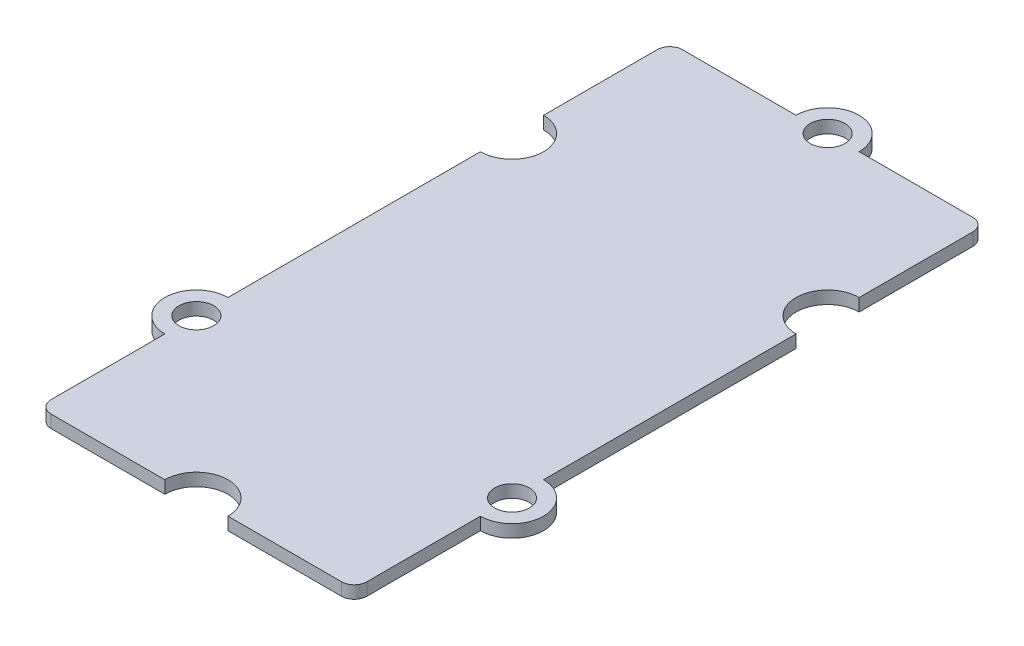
ISO-10303-21;
HEADER;
FILE_DESCRIPTION(('STEP AP214'),'2;1');
FILE_NAME('part.step','',(''),(''),'','','');
FILE_SCHEMA(('AUTOMOTIVE_DESIGN { 1 0 10303 214 1 1 1 1 }'));
ENDSEC;
DATA;
#1=APPLICATION_CONTEXT('core data for automotive mechanical design processes');
#2=APPLICATION_PROTOCOL_DEFINITION('international standard','automotive_design',2000,#1);
#3=PRODUCT_CONTEXT('',#1,'mechanical');
#4=PRODUCT('Part','Part','',(#3));
#5=PRODUCT_RELATED_PRODUCT_CATEGORY('part','',(#4));
#6=PRODUCT_DEFINITION_FORMATION('','',#4);
#7=PRODUCT_DEFINITION_CONTEXT('part definition',#1,'design');
#8=PRODUCT_DEFINITION('design','',#6,#7);
#9=PRODUCT_DEFINITION_SHAPE('','',#8);
#10=(LENGTH_UNIT() NAMED_UNIT(*) SI_UNIT(.MILLI.,.METRE.));
#11=(NAMED_UNIT(*) PLANE_ANGLE_UNIT() SI_UNIT($,.RADIAN.));
#12=(NAMED_UNIT(*) SI_UNIT($,.STERADIAN.) SOLID_ANGLE_UNIT());
#13=UNCERTAINTY_MEASURE_WITH_UNIT(LENGTH_MEASURE(1.E-05),#10,'distance_accuracy_value','');
#14=(GEOMETRIC_REPRESENTATION_CONTEXT(3) GLOBAL_UNCERTAINTY_ASSIGNED_CONTEXT((#13)) GLOBAL_UNIT_ASSIGNED_CONTEXT((#10,
#11,#12)) REPRESENTATION_CONTEXT('',''));
#15=CARTESIAN_POINT('',(0.,0.,0.));
#16=DIRECTION('',(0.,0.,1.));
#17=DIRECTION('',(1.,0.,0.));
#18=AXIS2_PLACEMENT_3D('',#15,#16,#17);
#19=CARTESIAN_POINT('',(0.8,0.8,-0.8));
#20=DIRECTION('',(0.,-1.,0.));
#21=DIRECTION('',(0.,0.,-1.));
#22=AXIS2_PLACEMENT_3D('',#19,#20,#21);
#23=PLANE('',#22);
#24=CARTESIAN_POINT('',(0.8,0.8,-0.8));
#25=DIRECTION('',(0.,1.,0.));
#26=DIRECTION('',(0.,0.,-1.));
#27=AXIS2_PLACEMENT_3D('',#24,#25,#26);
#28=CIRCLE('',#27,0.8);
#29=CARTESIAN_POINT('',(0.,0.8,-0.800000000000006));
#30=VERTEX_POINT('',#29);
#31=CARTESIAN_POINT('',(0.800000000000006,0.8,0.));
#32=VERTEX_POINT('',#31);
#33=EDGE_CURVE('E242',#30,#32,#28,.T.);
#34=ORIENTED_EDGE('',*,*,#33,.T.);
#35=DIRECTION('',(1.,0.,0.));
#36=VECTOR('',#35,1.);
#37=CARTESIAN_POINT('',(0.800000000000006,0.8,0.));
#38=LINE('',#37,#36);
#39=CARTESIAN_POINT('',(8.,0.8,0.));
#40=VERTEX_POINT('',#39);
#41=EDGE_CURVE('E130',#32,#40,#38,.T.);
#42=ORIENTED_EDGE('',*,*,#41,.T.);
#43=CARTESIAN_POINT('',(10.,0.8,0.));
#44=DIRECTION('',(0.,-1.,0.));
#45=DIRECTION('',(0.,0.,1.));
#46=AXIS2_PLACEMENT_3D('',#43,#44,#45);
#47=CIRCLE('',#46,2.);
#48=CARTESIAN_POINT('',(12.,0.8,0.));
#49=VERTEX_POINT('',#48);
#50=EDGE_CURVE('E293',#40,#49,#47,.T.);
#51=ORIENTED_EDGE('',*,*,#50,.T.);
#52=DIRECTION('',(1.,0.,0.));
#53=VECTOR('',#52,1.);
#54=CARTESIAN_POINT('',(12.,0.8,0.));
#55=LINE('',#54,#53);
#56=CARTESIAN_POINT('',(19.2,0.8,0.));
#57=VERTEX_POINT('',#56);
#58=EDGE_CURVE('E312',#49,#57,#55,.T.);
#59=ORIENTED_EDGE('',*,*,#58,.T.);
#60=CARTESIAN_POINT('',(19.2,0.8,-0.8));
#61=DIRECTION('',(0.,1.,0.));
#62=DIRECTION('',(0.,0.,1.));
#63=AXIS2_PLACEMENT_3D('',#60,#61,#62);
#64=CIRCLE('',#63,0.799999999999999);
#65=CARTESIAN_POINT('',(20.,0.8,-0.800000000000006));
#66=VERTEX_POINT('',#65);
#67=EDGE_CURVE('E309',#57,#66,#64,.T.);
#68=ORIENTED_EDGE('',*,*,#67,.T.);
#69=DIRECTION('',(0.,0.,-1.));
#70=VECTOR('',#69,1.);
#71=CARTESIAN_POINT('',(20.,0.8,-0.800000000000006));
#72=LINE('',#71,#70);
#73=CARTESIAN_POINT('',(20.,0.8,-8.));
#74=VERTEX_POINT('',#73);
#75=EDGE_CURVE('E311',#66,#74,#72,.T.);
#76=ORIENTED_EDGE('',*,*,#75,.T.);
#77=CARTESIAN_POINT('',(20.,0.8,-10.));
#78=DIRECTION('',(0.,1.,0.));
#79=DIRECTION('',(0.,0.,1.));
#80=AXIS2_PLACEMENT_3D('',#77,#78,#79);
#81=CIRCLE('',#80,2.);
#82=CARTESIAN_POINT('',(20.,0.8,-12.));
#83=VERTEX_POINT('',#82);
#84=EDGE_CURVE('E314',#74,#83,#81,.T.);
#85=ORIENTED_EDGE('',*,*,#84,.T.);
#86=DIRECTION('',(0.,0.,-1.));
#87=VECTOR('',#86,1.);
#88=CARTESIAN_POINT('',(20.,0.8,-12.));
#89=LINE('',#88,#87);
#90=CARTESIAN_POINT('',(20.,0.8,-28.));
#91=VERTEX_POINT('',#90);
#92=EDGE_CURVE('E320',#83,#91,#89,.T.);
#93=ORIENTED_EDGE('',*,*,#92,.T.);
#94=CARTESIAN_POINT('',(20.,0.8,-30.));
#95=DIRECTION('',(0.,-1.,0.));
#96=DIRECTION('',(0.,0.,1.));
#97=AXIS2_PLACEMENT_3D('',#94,#95,#96);
#98=CIRCLE('',#97,2.);
#99=CARTESIAN_POINT('',(20.,0.8,-32.));
#100=VERTEX_POINT('',#99);
#101=EDGE_CURVE('E322',#91,#100,#98,.T.);
#102=ORIENTED_EDGE('',*,*,#101,.T.);
#103=DIRECTION('',(0.,0.,-1.));
#104=VECTOR('',#103,1.);
#105=CARTESIAN_POINT('',(20.,0.8,-32.));
#106=LINE('',#105,#104);
#107=CARTESIAN_POINT('',(20.,0.8,-39.2));
#108=VERTEX_POINT('',#107);
#109=EDGE_CURVE('E324',#100,#108,#106,.T.);
#110=ORIENTED_EDGE('',*,*,#109,.T.);
#111=CARTESIAN_POINT('',(19.2,0.8,-39.2));
#112=DIRECTION('',(0.,1.,0.));
#113=DIRECTION('',(0.,0.,-1.));
#114=AXIS2_PLACEMENT_3D('',#111,#112,#113);
#115=CIRCLE('',#114,0.8);
#116=CARTESIAN_POINT('',(19.2,0.8,-40.));
#117=VERTEX_POINT('',#116);
#118=EDGE_CURVE('E326',#108,#117,#115,.T.);
#119=ORIENTED_EDGE('',*,*,#118,.T.);
#120=DIRECTION('',(-1.,0.,0.));
#121=VECTOR('',#120,1.);
#122=CARTESIAN_POINT('',(12.,0.8,-40.));
#123=LINE('',#122,#121);
#124=CARTESIAN_POINT('',(12.,0.8,-40.));
#125=VERTEX_POINT('',#124);
#126=EDGE_CURVE('E328',#117,#125,#123,.T.);
#127=ORIENTED_EDGE('',*,*,#126,.T.);
#128=CARTESIAN_POINT('',(10.,0.8,-40.));
#129=DIRECTION('',(0.,1.,0.));
#130=DIRECTION('',(0.,0.,1.));
#131=AXIS2_PLACEMENT_3D('',#128,#129,#130);
#132=CIRCLE('',#131,2.);
#133=CARTESIAN_POINT('',(8.,0.8,-40.));
#134=VERTEX_POINT('',#133);
#135=EDGE_CURVE('E330',#125,#134,#132,.T.);
#136=ORIENTED_EDGE('',*,*,#135,.T.);
#137=DIRECTION('',(-1.,0.,0.));
#138=VECTOR('',#137,1.);
#139=CARTESIAN_POINT('',(0.800000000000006,0.8,-40.));
#140=LINE('',#139,#138);
#141=CARTESIAN_POINT('',(0.800000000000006,0.8,-40.));
#142=VERTEX_POINT('',#141);
#143=EDGE_CURVE('E332',#134,#142,#140,.T.);
#144=ORIENTED_EDGE('',*,*,#143,.T.);
#145=CARTESIAN_POINT('',(0.8,0.8,-39.2));
#146=DIRECTION('',(0.,1.,0.));
#147=DIRECTION('',(0.,0.,-1.));
#148=AXIS2_PLACEMENT_3D('',#145,#146,#147);
#149=CIRCLE('',#148,0.800000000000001);
#150=CARTESIAN_POINT('',(0.,0.8,-39.2));
#151=VERTEX_POINT('',#150);
#152=EDGE_CURVE('E334',#142,#151,#149,.T.);
#153=ORIENTED_EDGE('',*,*,#152,.T.);
#154=DIRECTION('',(0.,0.,1.));
#155=VECTOR('',#154,1.);
#156=CARTESIAN_POINT('',(0.,0.8,-32.));
#157=LINE('',#156,#155);
#158=CARTESIAN_POINT('',(0.,0.8,-32.));
#159=VERTEX_POINT('',#158);
#160=EDGE_CURVE('E336',#151,#159,#157,.T.);
#161=ORIENTED_EDGE('',*,*,#160,.T.);
#162=CARTESIAN_POINT('',(0.,0.8,-30.));
#163=DIRECTION('',(0.,-1.,0.));
#164=DIRECTION('',(0.,0.,1.));
#165=AXIS2_PLACEMENT_3D('',#162,#163,#164);
#166=CIRCLE('',#165,2.);
#167=CARTESIAN_POINT('',(0.,0.8,-28.));
#168=VERTEX_POINT('',#167);
#169=EDGE_CURVE('E185',#159,#168,#166,.T.);
#170=ORIENTED_EDGE('',*,*,#169,.T.);
#171=DIRECTION('',(0.,0.,1.));
#172=VECTOR('',#171,1.);
#173=CARTESIAN_POINT('',(0.,0.8,-12.));
#174=LINE('',#173,#172);
#175=CARTESIAN_POINT('',(0.,0.8,-12.));
#176=VERTEX_POINT('',#175);
#177=EDGE_CURVE('E179',#168,#176,#174,.T.);
#178=ORIENTED_EDGE('',*,*,#177,.T.);
#179=CARTESIAN_POINT('',(0.,0.8,-10.));
#180=DIRECTION('',(0.,1.,0.));
#181=DIRECTION('',(0.,0.,1.));
#182=AXIS2_PLACEMENT_3D('',#179,#180,#181);
#183=CIRCLE('',#182,2.);
#184=CARTESIAN_POINT('',(0.,0.8,-8.));
#185=VERTEX_POINT('',#184);
#186=EDGE_CURVE('E183',#176,#185,#183,.T.);
#187=ORIENTED_EDGE('',*,*,#186,.T.);
#188=DIRECTION('',(0.,0.,1.));
#189=VECTOR('',#188,1.);
#190=CARTESIAN_POINT('',(0.,0.8,-0.800000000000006));
#191=LINE('',#190,#189);
#192=EDGE_CURVE('E51',#185,#30,#191,.T.);
#193=ORIENTED_EDGE('',*,*,#192,.T.);
#194=EDGE_LOOP('',(#34,#42,#51,#59,#68,#76,#85,#93,#102,#110,#119,#127,#136,#144,#153,#161,#170,
#178,#187,#193));
#195=FACE_BOUND('',#194,.T.);
#196=CARTESIAN_POINT('',(10.,0.8,-40.));
#197=DIRECTION('',(0.,1.,0.));
#198=DIRECTION('',(0.,0.,1.));
#199=AXIS2_PLACEMENT_3D('',#196,#197,#198);
#200=CIRCLE('',#199,1.1);
#201=CARTESIAN_POINT('',(10.,0.8,-38.9));
#202=VERTEX_POINT('',#201);
#203=EDGE_CURVE('E207',#202,#202,#200,.T.);
#204=ORIENTED_EDGE('',*,*,#203,.F.);
#205=EDGE_LOOP('',(#204));
#206=FACE_BOUND('',#205,.T.);
#207=CARTESIAN_POINT('',(20.,0.8,-10.));
#208=DIRECTION('',(0.,1.,0.));
#209=DIRECTION('',(0.,0.,1.));
#210=AXIS2_PLACEMENT_3D('',#207,#208,#209);
#211=CIRCLE('',#210,1.1);
#212=CARTESIAN_POINT('',(20.,0.8,-8.9));
#213=VERTEX_POINT('',#212);
#214=EDGE_CURVE('E390',#213,#213,#211,.T.);
#215=ORIENTED_EDGE('',*,*,#214,.F.);
#216=EDGE_LOOP('',(#215));
#217=FACE_BOUND('',#216,.T.);
#218=CARTESIAN_POINT('',(0.,0.8,-10.));
#219=DIRECTION('',(0.,1.,0.));
#220=DIRECTION('',(0.,0.,1.));
#221=AXIS2_PLACEMENT_3D('',#218,#219,#220);
#222=CIRCLE('',#221,1.1);
#223=CARTESIAN_POINT('',(0.,0.8,-8.9));
#224=VERTEX_POINT('',#223);
#225=EDGE_CURVE('E381',#224,#224,#222,.T.);
#226=ORIENTED_EDGE('',*,*,#225,.F.);
#227=EDGE_LOOP('',(#226));
#228=FACE_BOUND('',#227,.T.);
#229=ADVANCED_FACE('F34',(#195,#206,#217,#228),#23,.F.);
#230=CARTESIAN_POINT('',(0.8,0.,-0.8));
#231=DIRECTION('',(0.,-1.,0.));
#232=DIRECTION('',(0.,0.,-1.));
#233=AXIS2_PLACEMENT_3D('',#230,#231,#232);
#234=PLANE('',#233);
#235=CARTESIAN_POINT('',(20.,0.,-10.));
#236=DIRECTION('',(0.,1.,0.));
#237=DIRECTION('',(0.,0.,1.));
#238=AXIS2_PLACEMENT_3D('',#235,#236,#237);
#239=CIRCLE('',#238,1.1);
#240=CARTESIAN_POINT('',(20.,0.,-8.9));
#241=VERTEX_POINT('',#240);
#242=EDGE_CURVE('E387',#241,#241,#239,.T.);
#243=ORIENTED_EDGE('',*,*,#242,.T.);
#244=EDGE_LOOP('',(#243));
#245=FACE_BOUND('',#244,.T.);
#246=CARTESIAN_POINT('',(0.8,0.,-0.8));
#247=DIRECTION('',(0.,1.,0.));
#248=DIRECTION('',(0.,0.,-1.));
#249=AXIS2_PLACEMENT_3D('',#246,#247,#248);
#250=CIRCLE('',#249,0.8);
#251=CARTESIAN_POINT('',(0.,0.,-0.800000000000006));
#252=VERTEX_POINT('',#251);
#253=CARTESIAN_POINT('',(0.800000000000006,0.,0.));
#254=VERTEX_POINT('',#253);
#255=EDGE_CURVE('E203',#252,#254,#250,.T.);
#256=ORIENTED_EDGE('',*,*,#255,.F.);
#257=DIRECTION('',(0.,0.,1.));
#258=VECTOR('',#257,1.);
#259=CARTESIAN_POINT('',(0.,0.,-0.800000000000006));
#260=LINE('',#259,#258);
#261=CARTESIAN_POINT('',(0.,0.,-8.));
#262=VERTEX_POINT('',#261);
#263=EDGE_CURVE('E122',#262,#252,#260,.T.);
#264=ORIENTED_EDGE('',*,*,#263,.F.);
#265=CARTESIAN_POINT('',(0.,0.,-10.));
#266=DIRECTION('',(0.,1.,0.));
#267=DIRECTION('',(0.,0.,1.));
#268=AXIS2_PLACEMENT_3D('',#265,#266,#267);
#269=CIRCLE('',#268,2.);
#270=CARTESIAN_POINT('',(0.,0.,-12.));
#271=VERTEX_POINT('',#270);
#272=EDGE_CURVE('E116',#271,#262,#269,.T.);
#273=ORIENTED_EDGE('',*,*,#272,.F.);
#274=DIRECTION('',(0.,0.,1.));
#275=VECTOR('',#274,1.);
#276=CARTESIAN_POINT('',(0.,0.,-12.));
#277=LINE('',#276,#275);
#278=CARTESIAN_POINT('',(0.,0.,-28.));
#279=VERTEX_POINT('',#278);
#280=EDGE_CURVE('E193',#279,#271,#277,.T.);
#281=ORIENTED_EDGE('',*,*,#280,.F.);
#282=CARTESIAN_POINT('',(0.,0.,-30.));
#283=DIRECTION('',(0.,-1.,0.));
#284=DIRECTION('',(0.,0.,1.));
#285=AXIS2_PLACEMENT_3D('',#282,#283,#284);
#286=CIRCLE('',#285,2.);
#287=CARTESIAN_POINT('',(0.,0.,-32.));
#288=VERTEX_POINT('',#287);
#289=EDGE_CURVE('E237',#288,#279,#286,.T.);
#290=ORIENTED_EDGE('',*,*,#289,.F.);
#291=DIRECTION('',(0.,0.,1.));
#292=VECTOR('',#291,1.);
#293=CARTESIAN_POINT('',(0.,0.,-32.));
#294=LINE('',#293,#292);
#295=CARTESIAN_POINT('',(0.,0.,-39.2));
#296=VERTEX_POINT('',#295);
#297=EDGE_CURVE('E235',#296,#288,#294,.T.);
#298=ORIENTED_EDGE('',*,*,#297,.F.);
#299=CARTESIAN_POINT('',(0.8,0.,-39.2));
#300=DIRECTION('',(0.,1.,0.));
#301=DIRECTION('',(0.,0.,-1.));
#302=AXIS2_PLACEMENT_3D('',#299,#300,#301);
#303=CIRCLE('',#302,0.800000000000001);
#304=CARTESIAN_POINT('',(0.800000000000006,0.,-40.));
#305=VERTEX_POINT('',#304);
#306=EDGE_CURVE('E233',#305,#296,#303,.T.);
#307=ORIENTED_EDGE('',*,*,#306,.F.);
#308=DIRECTION('',(-1.,0.,0.));
#309=VECTOR('',#308,1.);
#310=CARTESIAN_POINT('',(0.800000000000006,0.,-40.));
#311=LINE('',#310,#309);
#312=CARTESIAN_POINT('',(8.,0.,-40.));
#313=VERTEX_POINT('',#312);
#314=EDGE_CURVE('E231',#313,#305,#311,.T.);
#315=ORIENTED_EDGE('',*,*,#314,.F.);
#316=CARTESIAN_POINT('',(10.,0.,-40.));
#317=DIRECTION('',(0.,1.,0.));
#318=DIRECTION('',(0.,0.,1.));
#319=AXIS2_PLACEMENT_3D('',#316,#317,#318);
#320=CIRCLE('',#319,2.);
#321=CARTESIAN_POINT('',(12.,0.,-40.));
#322=VERTEX_POINT('',#321);
#323=EDGE_CURVE('E229',#322,#313,#320,.T.);
#324=ORIENTED_EDGE('',*,*,#323,.F.);
#325=DIRECTION('',(-1.,0.,0.));
#326=VECTOR('',#325,1.);
#327=CARTESIAN_POINT('',(12.,0.,-40.));
#328=LINE('',#327,#326);
#329=CARTESIAN_POINT('',(19.2,0.,-40.));
#330=VERTEX_POINT('',#329);
#331=EDGE_CURVE('E227',#330,#322,#328,.T.);
#332=ORIENTED_EDGE('',*,*,#331,.F.);
#333=CARTESIAN_POINT('',(19.2,0.,-39.2));
#334=DIRECTION('',(0.,1.,0.));
#335=DIRECTION('',(0.,0.,-1.));
#336=AXIS2_PLACEMENT_3D('',#333,#334,#335);
#337=CIRCLE('',#336,0.8);
#338=CARTESIAN_POINT('',(20.,0.,-39.2));
#339=VERTEX_POINT('',#338);
#340=EDGE_CURVE('E225',#339,#330,#337,.T.);
#341=ORIENTED_EDGE('',*,*,#340,.F.);
#342=DIRECTION('',(0.,0.,-1.));
#343=VECTOR('',#342,1.);
#344=CARTESIAN_POINT('',(20.,0.,-32.));
#345=LINE('',#344,#343);
#346=CARTESIAN_POINT('',(20.,0.,-32.));
#347=VERTEX_POINT('',#346);
#348=EDGE_CURVE('E223',#347,#339,#345,.T.);
#349=ORIENTED_EDGE('',*,*,#348,.F.);
#350=CARTESIAN_POINT('',(20.,0.,-30.));
#351=DIRECTION('',(0.,-1.,0.));
#352=DIRECTION('',(0.,0.,1.));
#353=AXIS2_PLACEMENT_3D('',#350,#351,#352);
#354=CIRCLE('',#353,2.);
#355=CARTESIAN_POINT('',(20.,0.,-28.));
#356=VERTEX_POINT('',#355);
#357=EDGE_CURVE('E221',#356,#347,#354,.T.);
#358=ORIENTED_EDGE('',*,*,#357,.F.);
#359=DIRECTION('',(0.,0.,-1.));
#360=VECTOR('',#359,1.);
#361=CARTESIAN_POINT('',(20.,0.,-12.));
#362=LINE('',#361,#360);
#363=CARTESIAN_POINT('',(20.,0.,-12.));
#364=VERTEX_POINT('',#363);
#365=EDGE_CURVE('E219',#364,#356,#362,.T.);
#366=ORIENTED_EDGE('',*,*,#365,.F.);
#367=CARTESIAN_POINT('',(20.,0.,-10.));
#368=DIRECTION('',(0.,1.,0.));
#369=DIRECTION('',(0.,0.,1.));
#370=AXIS2_PLACEMENT_3D('',#367,#368,#369);
#371=CIRCLE('',#370,2.);
#372=CARTESIAN_POINT('',(20.,0.,-8.));
#373=VERTEX_POINT('',#372);
#374=EDGE_CURVE('E217',#373,#364,#371,.T.);
#375=ORIENTED_EDGE('',*,*,#374,.F.);
#376=DIRECTION('',(0.,0.,-1.));
#377=VECTOR('',#376,1.);
#378=CARTESIAN_POINT('',(20.,0.,-0.800000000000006));
#379=LINE('',#378,#377);
#380=CARTESIAN_POINT('',(20.,0.,-0.800000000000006));
#381=VERTEX_POINT('',#380);
#382=EDGE_CURVE('E215',#381,#373,#379,.T.);
#383=ORIENTED_EDGE('',*,*,#382,.F.);
#384=CARTESIAN_POINT('',(19.2,0.,-0.8));
#385=DIRECTION('',(0.,1.,0.));
#386=DIRECTION('',(0.,0.,1.));
#387=AXIS2_PLACEMENT_3D('',#384,#385,#386);
#388=CIRCLE('',#387,0.799999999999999);
#389=CARTESIAN_POINT('',(19.2,0.,0.));
#390=VERTEX_POINT('',#389);
#391=EDGE_CURVE('E213',#390,#381,#388,.T.);
#392=ORIENTED_EDGE('',*,*,#391,.F.);
#393=DIRECTION('',(1.,0.,0.));
#394=VECTOR('',#393,1.);
#395=CARTESIAN_POINT('',(12.,0.,0.));
#396=LINE('',#395,#394);
#397=CARTESIAN_POINT('',(12.,0.,0.));
#398=VERTEX_POINT('',#397);
#399=EDGE_CURVE('E211',#398,#390,#396,.T.);
#400=ORIENTED_EDGE('',*,*,#399,.F.);
#401=CARTESIAN_POINT('',(10.,0.,0.));
#402=DIRECTION('',(0.,-1.,0.));
#403=DIRECTION('',(0.,0.,1.));
#404=AXIS2_PLACEMENT_3D('',#401,#402,#403);
#405=CIRCLE('',#404,2.);
#406=CARTESIAN_POINT('',(8.,0.,0.));
#407=VERTEX_POINT('',#406);
#408=EDGE_CURVE('E209',#407,#398,#405,.T.);
#409=ORIENTED_EDGE('',*,*,#408,.F.);
#410=DIRECTION('',(1.,0.,0.));
#411=VECTOR('',#410,1.);
#412=CARTESIAN_POINT('',(0.800000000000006,0.,0.));
#413=LINE('',#412,#411);
#414=EDGE_CURVE('E206',#254,#407,#413,.T.);
#415=ORIENTED_EDGE('',*,*,#414,.F.);
#416=EDGE_LOOP('',(#256,#264,#273,#281,#290,#298,#307,#315,#324,#332,#341,#349,#358,#366,#375,
#383,#392,#400,#409,#415));
#417=FACE_BOUND('',#416,.T.);
#418=CARTESIAN_POINT('',(10.,0.,-40.));
#419=DIRECTION('',(0.,1.,0.));
#420=DIRECTION('',(0.,0.,1.));
#421=AXIS2_PLACEMENT_3D('',#418,#419,#420);
#422=CIRCLE('',#421,1.1);
#423=CARTESIAN_POINT('',(10.,0.,-38.9));
#424=VERTEX_POINT('',#423);
#425=EDGE_CURVE('E393',#424,#424,#422,.T.);
#426=ORIENTED_EDGE('',*,*,#425,.T.);
#427=EDGE_LOOP('',(#426));
#428=FACE_BOUND('',#427,.T.);
#429=CARTESIAN_POINT('',(0.,0.,-10.));
#430=DIRECTION('',(0.,1.,0.));
#431=DIRECTION('',(0.,0.,1.));
#432=AXIS2_PLACEMENT_3D('',#429,#430,#431);
#433=CIRCLE('',#432,1.1);
#434=CARTESIAN_POINT('',(0.,0.,-8.9));
#435=VERTEX_POINT('',#434);
#436=EDGE_CURVE('E384',#435,#435,#433,.T.);
#437=ORIENTED_EDGE('',*,*,#436,.T.);
#438=EDGE_LOOP('',(#437));
#439=FACE_BOUND('',#438,.T.);
#440=ADVANCED_FACE('F297',(#245,#417,#428,#439),#234,.T.);
#441=CARTESIAN_POINT('',(0.8,0.8,-0.8));
#442=DIRECTION('',(0.,-1.,0.));
#443=DIRECTION('',(0.,0.,-1.));
#444=AXIS2_PLACEMENT_3D('',#441,#442,#443);
#445=CYLINDRICAL_SURFACE('',#444,0.8);
#446=ORIENTED_EDGE('',*,*,#255,.T.);
#447=DIRECTION('',(0.,-1.,0.));
#448=VECTOR('',#447,1.);
#449=CARTESIAN_POINT('',(0.800000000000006,0.8,0.));
#450=LINE('',#449,#448);
#451=EDGE_CURVE('E11',#32,#254,#450,.T.);
#452=ORIENTED_EDGE('',*,*,#451,.F.);
#453=ORIENTED_EDGE('',*,*,#33,.F.);
#454=DIRECTION('',(0.,-1.,0.));
#455=VECTOR('',#454,1.);
#456=CARTESIAN_POINT('',(0.,0.8,-0.800000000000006));
#457=LINE('',#456,#455);
#458=EDGE_CURVE('E199',#30,#252,#457,.T.);
#459=ORIENTED_EDGE('',*,*,#458,.T.);
#460=EDGE_LOOP('',(#446,#452,#453,#459));
#461=FACE_BOUND('',#460,.T.);
#462=ADVANCED_FACE('F36',(#461),#445,.T.);
#463=CARTESIAN_POINT('',(0.800000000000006,0.8,0.));
#464=DIRECTION('',(0.,0.,-1.));
#465=DIRECTION('',(-1.,0.,0.));
#466=AXIS2_PLACEMENT_3D('',#463,#464,#465);
#467=PLANE('',#466);
#468=ORIENTED_EDGE('',*,*,#414,.T.);
#469=DIRECTION('',(0.,-1.,0.));
#470=VECTOR('',#469,1.);
#471=CARTESIAN_POINT('',(8.,0.8,0.));
#472=LINE('',#471,#470);
#473=EDGE_CURVE('E43',#40,#407,#472,.T.);
#474=ORIENTED_EDGE('',*,*,#473,.F.);
#475=ORIENTED_EDGE('',*,*,#41,.F.);
#476=ORIENTED_EDGE('',*,*,#451,.T.);
#477=EDGE_LOOP('',(#468,#474,#475,#476));
#478=FACE_BOUND('',#477,.T.);
#479=ADVANCED_FACE('F576',(#478),#467,.F.);
#480=CARTESIAN_POINT('',(10.,0.8,0.));
#481=DIRECTION('',(0.,-1.,0.));
#482=DIRECTION('',(0.,0.,-1.));
#483=AXIS2_PLACEMENT_3D('',#480,#481,#482);
#484=CYLINDRICAL_SURFACE('',#483,2.);
#485=ORIENTED_EDGE('',*,*,#408,.T.);
#486=DIRECTION('',(0.,-1.,0.));
#487=VECTOR('',#486,1.);
#488=CARTESIAN_POINT('',(12.,0.8,0.));
#489=LINE('',#488,#487);
#490=EDGE_CURVE('E285',#49,#398,#489,.T.);
#491=ORIENTED_EDGE('',*,*,#490,.F.);
#492=ORIENTED_EDGE('',*,*,#50,.F.);
#493=ORIENTED_EDGE('',*,*,#473,.T.);
#494=EDGE_LOOP('',(#485,#491,#492,#493));
#495=FACE_BOUND('',#494,.T.);
#496=ADVANCED_FACE('F291',(#495),#484,.F.);
#497=CARTESIAN_POINT('',(12.,0.8,0.));
#498=DIRECTION('',(0.,0.,-1.));
#499=DIRECTION('',(-1.,0.,0.));
#500=AXIS2_PLACEMENT_3D('',#497,#498,#499);
#501=PLANE('',#500);
#502=ORIENTED_EDGE('',*,*,#399,.T.);
#503=DIRECTION('',(0.,-1.,0.));
#504=VECTOR('',#503,1.);
#505=CARTESIAN_POINT('',(19.2,0.8,0.));
#506=LINE('',#505,#504);
#507=EDGE_CURVE('E282',#57,#390,#506,.T.);
#508=ORIENTED_EDGE('',*,*,#507,.F.);
#509=ORIENTED_EDGE('',*,*,#58,.F.);
#510=ORIENTED_EDGE('',*,*,#490,.T.);
#511=EDGE_LOOP('',(#502,#508,#509,#510));
#512=FACE_BOUND('',#511,.T.);
#513=ADVANCED_FACE('F303',(#512),#501,.F.);
#514=CARTESIAN_POINT('',(19.2,0.8,-0.8));
#515=DIRECTION('',(0.,-1.,0.));
#516=DIRECTION('',(0.,0.,-1.));
#517=AXIS2_PLACEMENT_3D('',#514,#515,#516);
#518=CYLINDRICAL_SURFACE('',#517,0.799999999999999);
#519=ORIENTED_EDGE('',*,*,#391,.T.);
#520=DIRECTION('',(0.,-1.,0.));
#521=VECTOR('',#520,1.);
#522=CARTESIAN_POINT('',(20.,0.8,-0.800000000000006));
#523=LINE('',#522,#521);
#524=EDGE_CURVE('E279',#66,#381,#523,.T.);
#525=ORIENTED_EDGE('',*,*,#524,.F.);
#526=ORIENTED_EDGE('',*,*,#67,.F.);
#527=ORIENTED_EDGE('',*,*,#507,.T.);
#528=EDGE_LOOP('',(#519,#525,#526,#527));
#529=FACE_BOUND('',#528,.T.);
#530=ADVANCED_FACE('F307',(#529),#518,.T.);
#531=CARTESIAN_POINT('',(20.,0.8,-0.800000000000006));
#532=DIRECTION('',(-1.,0.,0.));
#533=DIRECTION('',(0.,0.,1.));
#534=AXIS2_PLACEMENT_3D('',#531,#532,#533);
#535=PLANE('',#534);
#536=ORIENTED_EDGE('',*,*,#382,.T.);
#537=DIRECTION('',(0.,-1.,0.));
#538=VECTOR('',#537,1.);
#539=CARTESIAN_POINT('',(20.,0.8,-8.));
#540=LINE('',#539,#538);
#541=EDGE_CURVE('E276',#74,#373,#540,.T.);
#542=ORIENTED_EDGE('',*,*,#541,.F.);
#543=ORIENTED_EDGE('',*,*,#75,.F.);
#544=ORIENTED_EDGE('',*,*,#524,.T.);
#545=EDGE_LOOP('',(#536,#542,#543,#544));
#546=FACE_BOUND('',#545,.T.);
#547=ADVANCED_FACE('F541',(#546),#535,.F.);
#548=CARTESIAN_POINT('',(20.,0.8,-10.));
#549=DIRECTION('',(0.,-1.,0.));
#550=DIRECTION('',(0.,0.,-1.));
#551=AXIS2_PLACEMENT_3D('',#548,#549,#550);
#552=CYLINDRICAL_SURFACE('',#551,2.);
#553=ORIENTED_EDGE('',*,*,#374,.T.);
#554=DIRECTION('',(0.,-1.,0.));
#555=VECTOR('',#554,1.);
#556=CARTESIAN_POINT('',(20.,0.8,-12.));
#557=LINE('',#556,#555);
#558=EDGE_CURVE('E273',#83,#364,#557,.T.);
#559=ORIENTED_EDGE('',*,*,#558,.F.);
#560=ORIENTED_EDGE('',*,*,#84,.F.);
#561=ORIENTED_EDGE('',*,*,#541,.T.);
#562=EDGE_LOOP('',(#553,#559,#560,#561));
#563=FACE_BOUND('',#562,.T.);
#564=ADVANCED_FACE('F531',(#563),#552,.T.);
#565=CARTESIAN_POINT('',(20.,0.8,-12.));
#566=DIRECTION('',(-1.,0.,0.));
#567=DIRECTION('',(0.,0.,1.));
#568=AXIS2_PLACEMENT_3D('',#565,#566,#567);
#569=PLANE('',#568);
#570=ORIENTED_EDGE('',*,*,#365,.T.);
#571=DIRECTION('',(0.,-1.,0.));
#572=VECTOR('',#571,1.);
#573=CARTESIAN_POINT('',(20.,0.8,-28.));
#574=LINE('',#573,#572);
#575=EDGE_CURVE('E270',#91,#356,#574,.T.);
#576=ORIENTED_EDGE('',*,*,#575,.F.);
#577=ORIENTED_EDGE('',*,*,#92,.F.);
#578=ORIENTED_EDGE('',*,*,#558,.T.);
#579=EDGE_LOOP('',(#570,#576,#577,#578));
#580=FACE_BOUND('',#579,.T.);
#581=ADVANCED_FACE('F521',(#580),#569,.F.);
#582=CARTESIAN_POINT('',(20.,0.8,-30.));
#583=DIRECTION('',(0.,-1.,0.));
#584=DIRECTION('',(0.,0.,-1.));
#585=AXIS2_PLACEMENT_3D('',#582,#583,#584);
#586=CYLINDRICAL_SURFACE('',#585,2.);
#587=ORIENTED_EDGE('',*,*,#357,.T.);
#588=DIRECTION('',(0.,-1.,0.));
#589=VECTOR('',#588,1.);
#590=CARTESIAN_POINT('',(20.,0.8,-32.));
#591=LINE('',#590,#589);
#592=EDGE_CURVE('E267',#100,#347,#591,.T.);
#593=ORIENTED_EDGE('',*,*,#592,.F.);
#594=ORIENTED_EDGE('',*,*,#101,.F.);
#595=ORIENTED_EDGE('',*,*,#575,.T.);
#596=EDGE_LOOP('',(#587,#593,#594,#595));
#597=FACE_BOUND('',#596,.T.);
#598=ADVANCED_FACE('F511',(#597),#586,.F.);
#599=CARTESIAN_POINT('',(20.,0.8,-32.));
#600=DIRECTION('',(-1.,0.,0.));
#601=DIRECTION('',(0.,0.,1.));
#602=AXIS2_PLACEMENT_3D('',#599,#600,#601);
#603=PLANE('',#602);
#604=ORIENTED_EDGE('',*,*,#348,.T.);
#605=DIRECTION('',(0.,-1.,0.));
#606=VECTOR('',#605,1.);
#607=CARTESIAN_POINT('',(20.,0.8,-39.2));
#608=LINE('',#607,#606);
#609=EDGE_CURVE('E264',#108,#339,#608,.T.);
#610=ORIENTED_EDGE('',*,*,#609,.F.);
#611=ORIENTED_EDGE('',*,*,#109,.F.);
#612=ORIENTED_EDGE('',*,*,#592,.T.);
#613=EDGE_LOOP('',(#604,#610,#611,#612));
#614=FACE_BOUND('',#613,.T.);
#615=ADVANCED_FACE('F501',(#614),#603,.F.);
#616=CARTESIAN_POINT('',(19.2,0.8,-39.2));
#617=DIRECTION('',(0.,-1.,0.));
#618=DIRECTION('',(0.,0.,-1.));
#619=AXIS2_PLACEMENT_3D('',#616,#617,#618);
#620=CYLINDRICAL_SURFACE('',#619,0.8);
#621=ORIENTED_EDGE('',*,*,#340,.T.);
#622=DIRECTION('',(0.,-1.,0.));
#623=VECTOR('',#622,1.);
#624=CARTESIAN_POINT('',(19.2,0.8,-40.));
#625=LINE('',#624,#623);
#626=EDGE_CURVE('E261',#117,#330,#625,.T.);
#627=ORIENTED_EDGE('',*,*,#626,.F.);
#628=ORIENTED_EDGE('',*,*,#118,.F.);
#629=ORIENTED_EDGE('',*,*,#609,.T.);
#630=EDGE_LOOP('',(#621,#627,#628,#629));
#631=FACE_BOUND('',#630,.T.);
#632=ADVANCED_FACE('F491',(#631),#620,.T.);
#633=CARTESIAN_POINT('',(12.,0.8,-40.));
#634=DIRECTION('',(0.,0.,1.));
#635=DIRECTION('',(1.,0.,0.));
#636=AXIS2_PLACEMENT_3D('',#633,#634,#635);
#637=PLANE('',#636);
#638=ORIENTED_EDGE('',*,*,#331,.T.);
#639=DIRECTION('',(0.,-1.,0.));
#640=VECTOR('',#639,1.);
#641=CARTESIAN_POINT('',(12.,0.8,-40.));
#642=LINE('',#641,#640);
#643=EDGE_CURVE('E258',#125,#322,#642,.T.);
#644=ORIENTED_EDGE('',*,*,#643,.F.);
#645=ORIENTED_EDGE('',*,*,#126,.F.);
#646=ORIENTED_EDGE('',*,*,#626,.T.);
#647=EDGE_LOOP('',(#638,#644,#645,#646));
#648=FACE_BOUND('',#647,.T.);
#649=ADVANCED_FACE('F481',(#648),#637,.F.);
#650=CARTESIAN_POINT('',(10.,0.8,-40.));
#651=DIRECTION('',(0.,-1.,0.));
#652=DIRECTION('',(0.,0.,-1.));
#653=AXIS2_PLACEMENT_3D('',#650,#651,#652);
#654=CYLINDRICAL_SURFACE('',#653,2.);
#655=ORIENTED_EDGE('',*,*,#323,.T.);
#656=DIRECTION('',(0.,-1.,0.));
#657=VECTOR('',#656,1.);
#658=CARTESIAN_POINT('',(8.,0.8,-40.));
#659=LINE('',#658,#657);
#660=EDGE_CURVE('E255',#134,#313,#659,.T.);
#661=ORIENTED_EDGE('',*,*,#660,.F.);
#662=ORIENTED_EDGE('',*,*,#135,.F.);
#663=ORIENTED_EDGE('',*,*,#643,.T.);
#664=EDGE_LOOP('',(#655,#661,#662,#663));
#665=FACE_BOUND('',#664,.T.);
#666=ADVANCED_FACE('F471',(#665),#654,.T.);
#667=CARTESIAN_POINT('',(0.800000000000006,0.8,-40.));
#668=DIRECTION('',(0.,0.,1.));
#669=DIRECTION('',(1.,0.,0.));
#670=AXIS2_PLACEMENT_3D('',#667,#668,#669);
#671=PLANE('',#670);
#672=ORIENTED_EDGE('',*,*,#314,.T.);
#673=DIRECTION('',(0.,-1.,0.));
#674=VECTOR('',#673,1.);
#675=CARTESIAN_POINT('',(0.800000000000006,0.8,-40.));
#676=LINE('',#675,#674);
#677=EDGE_CURVE('E252',#142,#305,#676,.T.);
#678=ORIENTED_EDGE('',*,*,#677,.F.);
#679=ORIENTED_EDGE('',*,*,#143,.F.);
#680=ORIENTED_EDGE('',*,*,#660,.T.);
#681=EDGE_LOOP('',(#672,#678,#679,#680));
#682=FACE_BOUND('',#681,.T.);
#683=ADVANCED_FACE('F461',(#682),#671,.F.);
#684=CARTESIAN_POINT('',(0.8,0.8,-39.2));
#685=DIRECTION('',(0.,-1.,0.));
#686=DIRECTION('',(0.,0.,-1.));
#687=AXIS2_PLACEMENT_3D('',#684,#685,#686);
#688=CYLINDRICAL_SURFACE('',#687,0.800000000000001);
#689=ORIENTED_EDGE('',*,*,#306,.T.);
#690=DIRECTION('',(0.,-1.,0.));
#691=VECTOR('',#690,1.);
#692=CARTESIAN_POINT('',(0.,0.8,-39.2));
#693=LINE('',#692,#691);
#694=EDGE_CURVE('E249',#151,#296,#693,.T.);
#695=ORIENTED_EDGE('',*,*,#694,.F.);
#696=ORIENTED_EDGE('',*,*,#152,.F.);
#697=ORIENTED_EDGE('',*,*,#677,.T.);
#698=EDGE_LOOP('',(#689,#695,#696,#697));
#699=FACE_BOUND('',#698,.T.);
#700=ADVANCED_FACE('F452',(#699),#688,.T.);
#701=CARTESIAN_POINT('',(0.,0.8,-32.));
#702=DIRECTION('',(1.,0.,0.));
#703=DIRECTION('',(0.,0.,-1.));
#704=AXIS2_PLACEMENT_3D('',#701,#702,#703);
#705=PLANE('',#704);
#706=ORIENTED_EDGE('',*,*,#297,.T.);
#707=DIRECTION('',(0.,-1.,0.));
#708=VECTOR('',#707,1.);
#709=CARTESIAN_POINT('',(0.,0.8,-32.));
#710=LINE('',#709,#708);
#711=EDGE_CURVE('E246',#159,#288,#710,.T.);
#712=ORIENTED_EDGE('',*,*,#711,.F.);
#713=ORIENTED_EDGE('',*,*,#160,.F.);
#714=ORIENTED_EDGE('',*,*,#694,.T.);
#715=EDGE_LOOP('',(#706,#712,#713,#714));
#716=FACE_BOUND('',#715,.T.);
#717=ADVANCED_FACE('F342',(#716),#705,.F.);
#718=CARTESIAN_POINT('',(0.,0.8,-30.));
#719=DIRECTION('',(0.,-1.,0.));
#720=DIRECTION('',(0.,0.,-1.));
#721=AXIS2_PLACEMENT_3D('',#718,#719,#720);
#722=CYLINDRICAL_SURFACE('',#721,2.);
#723=ORIENTED_EDGE('',*,*,#289,.T.);
#724=DIRECTION('',(0.,-1.,0.));
#725=VECTOR('',#724,1.);
#726=CARTESIAN_POINT('',(0.,0.8,-28.));
#727=LINE('',#726,#725);
#728=EDGE_CURVE('E194',#168,#279,#727,.T.);
#729=ORIENTED_EDGE('',*,*,#728,.F.);
#730=ORIENTED_EDGE('',*,*,#169,.F.);
#731=ORIENTED_EDGE('',*,*,#711,.T.);
#732=EDGE_LOOP('',(#723,#729,#730,#731));
#733=FACE_BOUND('',#732,.T.);
#734=ADVANCED_FACE('F346',(#733),#722,.F.);
#735=CARTESIAN_POINT('',(0.,0.8,-12.));
#736=DIRECTION('',(1.,0.,0.));
#737=DIRECTION('',(0.,0.,-1.));
#738=AXIS2_PLACEMENT_3D('',#735,#736,#737);
#739=PLANE('',#738);
#740=ORIENTED_EDGE('',*,*,#280,.T.);
#741=DIRECTION('',(0.,-1.,0.));
#742=VECTOR('',#741,1.);
#743=CARTESIAN_POINT('',(0.,0.8,-12.));
#744=LINE('',#743,#742);
#745=EDGE_CURVE('E190',#176,#271,#744,.T.);
#746=ORIENTED_EDGE('',*,*,#745,.F.);
#747=ORIENTED_EDGE('',*,*,#177,.F.);
#748=ORIENTED_EDGE('',*,*,#728,.T.);
#749=EDGE_LOOP('',(#740,#746,#747,#748));
#750=FACE_BOUND('',#749,.T.);
#751=ADVANCED_FACE('F191',(#750),#739,.F.);
#752=CARTESIAN_POINT('',(0.,0.8,-10.));
#753=DIRECTION('',(0.,-1.,0.));
#754=DIRECTION('',(0.,0.,-1.));
#755=AXIS2_PLACEMENT_3D('',#752,#753,#754);
#756=CYLINDRICAL_SURFACE('',#755,2.);
#757=ORIENTED_EDGE('',*,*,#272,.T.);
#758=DIRECTION('',(0.,-1.,0.));
#759=VECTOR('',#758,1.);
#760=CARTESIAN_POINT('',(0.,0.8,-8.));
#761=LINE('',#760,#759);
#762=EDGE_CURVE('E195',#185,#262,#761,.T.);
#763=ORIENTED_EDGE('',*,*,#762,.F.);
#764=ORIENTED_EDGE('',*,*,#186,.F.);
#765=ORIENTED_EDGE('',*,*,#745,.T.);
#766=EDGE_LOOP('',(#757,#763,#764,#765));
#767=FACE_BOUND('',#766,.T.);
#768=ADVANCED_FACE('F197',(#767),#756,.T.);
#769=CARTESIAN_POINT('',(0.,0.8,-0.800000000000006));
#770=DIRECTION('',(1.,0.,0.));
#771=DIRECTION('',(0.,0.,-1.));
#772=AXIS2_PLACEMENT_3D('',#769,#770,#771);
#773=PLANE('',#772);
#774=ORIENTED_EDGE('',*,*,#263,.T.);
#775=ORIENTED_EDGE('',*,*,#458,.F.);
#776=ORIENTED_EDGE('',*,*,#192,.F.);
#777=ORIENTED_EDGE('',*,*,#762,.T.);
#778=EDGE_LOOP('',(#774,#775,#776,#777));
#779=FACE_BOUND('',#778,.T.);
#780=ADVANCED_FACE('F350',(#779),#773,.F.);
#781=CARTESIAN_POINT('',(10.,0.8,-40.));
#782=DIRECTION('',(0.,-1.,0.));
#783=DIRECTION('',(0.,0.,-1.));
#784=AXIS2_PLACEMENT_3D('',#781,#782,#783);
#785=CYLINDRICAL_SURFACE('',#784,1.1);
#786=ORIENTED_EDGE('',*,*,#203,.T.);
#787=EDGE_LOOP('',(#786));
#788=FACE_BOUND('',#787,.T.);
#789=ORIENTED_EDGE('',*,*,#425,.F.);
#790=EDGE_LOOP('',(#789));
#791=FACE_BOUND('',#790,.T.);
#792=ADVANCED_FACE('F352',(#788,#791),#785,.F.);
#793=CARTESIAN_POINT('',(20.,0.8,-10.));
#794=DIRECTION('',(0.,-1.,0.));
#795=DIRECTION('',(0.,0.,-1.));
#796=AXIS2_PLACEMENT_3D('',#793,#794,#795);
#797=CYLINDRICAL_SURFACE('',#796,1.1);
#798=ORIENTED_EDGE('',*,*,#214,.T.);
#799=EDGE_LOOP('',(#798));
#800=FACE_BOUND('',#799,.T.);
#801=ORIENTED_EDGE('',*,*,#242,.F.);
#802=EDGE_LOOP('',(#801));
#803=FACE_BOUND('',#802,.T.);
#804=ADVANCED_FACE('F358',(#800,#803),#797,.F.);
#805=CARTESIAN_POINT('',(0.,0.8,-10.));
#806=DIRECTION('',(0.,-1.,0.));
#807=DIRECTION('',(0.,0.,-1.));
#808=AXIS2_PLACEMENT_3D('',#805,#806,#807);
#809=CYLINDRICAL_SURFACE('',#808,1.1);
#810=ORIENTED_EDGE('',*,*,#225,.T.);
#811=EDGE_LOOP('',(#810));
#812=FACE_BOUND('',#811,.T.);
#813=ORIENTED_EDGE('',*,*,#436,.F.);
#814=EDGE_LOOP('',(#813));
#815=FACE_BOUND('',#814,.T.);
#816=ADVANCED_FACE('F372',(#812,#815),#809,.F.);
#817=CLOSED_SHELL('',(#229,#440,#462,#479,#496,#513,#530,#547,#564,#581,#598,#615,#632,#649,
#666,#683,#700,#717,#734,#751,#768,#780,#792,#804,#816));
#818=MANIFOLD_SOLID_BREP('B2',#817);
#819=ADVANCED_BREP_SHAPE_REPRESENTATION('',(#18,#818),#14);
#820=SHAPE_DEFINITION_REPRESENTATION(#9,#819);
ENDSEC;
END-ISO-10303-21;
